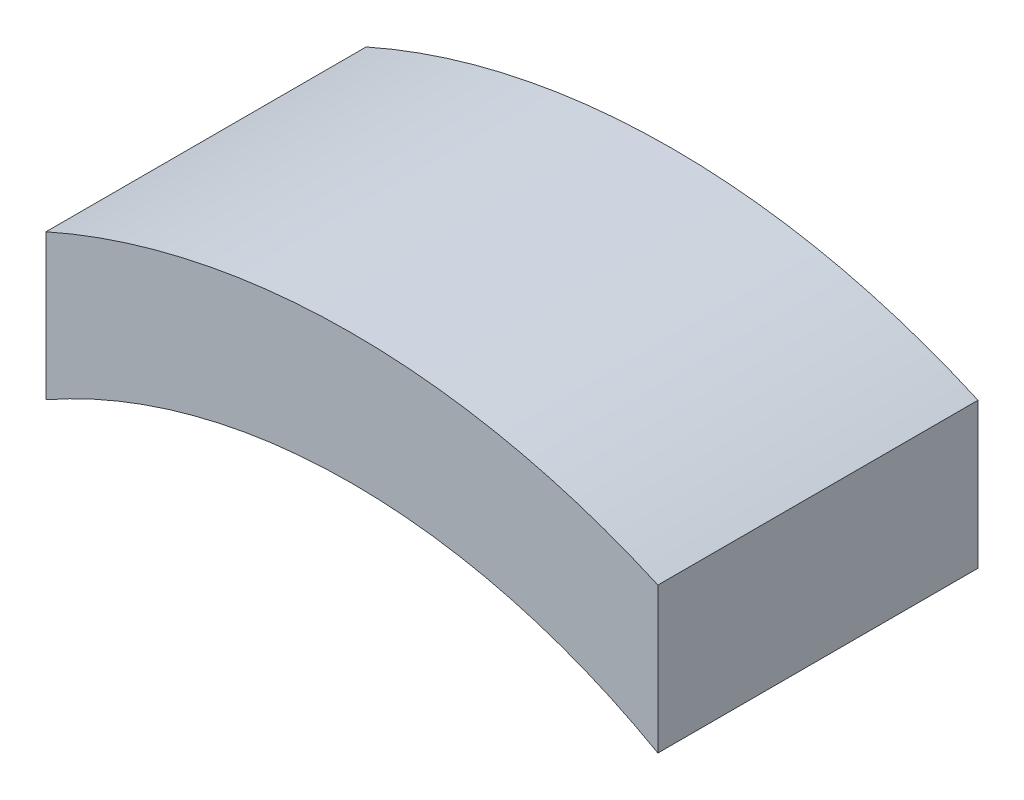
from build123d import *

# Parameters (mm, degrees)
EXTRUDE1_DEPTH = 36


with BuildPart() as part:
    # Sketch1 → Extrude1 (new, symmetric)
    with BuildSketch(Plane.XY):
        with BuildLine():
            Line((67.51231593, 0), (67.51231593, -32.727576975))
            ThreePointArc((67.51231593, -32.727576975), (-1.309103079, -14.598434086), (-70.130522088, -32.727576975))
            Line((-70.130522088, -32.727576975), (-70.130522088, 0))
            ThreePointArc((-70.130522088, 0), (-1.309103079, 14.652977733), (67.51231593, 0))
        make_face()
    extrude(amount=EXTRUDE1_DEPTH, both=True)


solid = part.part
